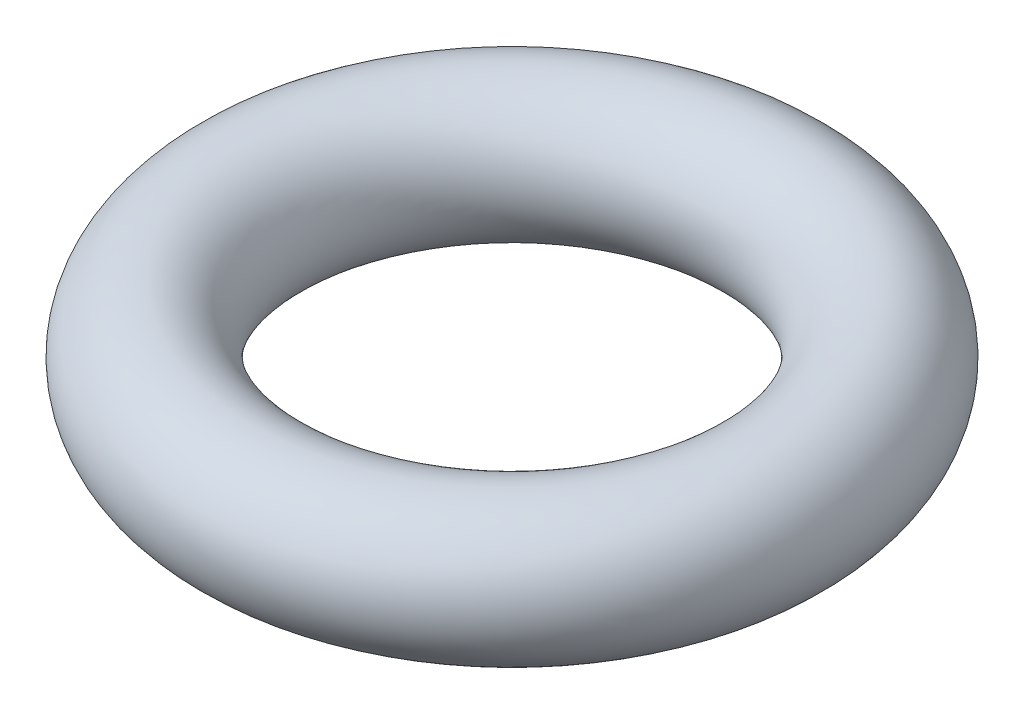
ISO-10303-21;
HEADER;
FILE_DESCRIPTION(('STEP AP214'),'2;1');
FILE_NAME('part.step','',(''),(''),'','','');
FILE_SCHEMA(('AUTOMOTIVE_DESIGN { 1 0 10303 214 1 1 1 1 }'));
ENDSEC;
DATA;
#1=APPLICATION_CONTEXT('core data for automotive mechanical design processes');
#2=APPLICATION_PROTOCOL_DEFINITION('international standard','automotive_design',2000,#1);
#3=PRODUCT_CONTEXT('',#1,'mechanical');
#4=PRODUCT('Part','Part','',(#3));
#5=PRODUCT_RELATED_PRODUCT_CATEGORY('part','',(#4));
#6=PRODUCT_DEFINITION_FORMATION('','',#4);
#7=PRODUCT_DEFINITION_CONTEXT('part definition',#1,'design');
#8=PRODUCT_DEFINITION('design','',#6,#7);
#9=PRODUCT_DEFINITION_SHAPE('','',#8);
#10=(LENGTH_UNIT() NAMED_UNIT(*) SI_UNIT(.MILLI.,.METRE.));
#11=(NAMED_UNIT(*) PLANE_ANGLE_UNIT() SI_UNIT($,.RADIAN.));
#12=(NAMED_UNIT(*) SI_UNIT($,.STERADIAN.) SOLID_ANGLE_UNIT());
#13=UNCERTAINTY_MEASURE_WITH_UNIT(LENGTH_MEASURE(1.E-05),#10,'distance_accuracy_value','');
#14=(GEOMETRIC_REPRESENTATION_CONTEXT(3) GLOBAL_UNCERTAINTY_ASSIGNED_CONTEXT((#13)) GLOBAL_UNIT_ASSIGNED_CONTEXT((#10,
#11,#12)) REPRESENTATION_CONTEXT('',''));
#15=CARTESIAN_POINT('',(0.,0.,0.));
#16=DIRECTION('',(0.,0.,1.));
#17=DIRECTION('',(1.,0.,0.));
#18=AXIS2_PLACEMENT_3D('',#15,#16,#17);
#19=CARTESIAN_POINT('',(0.,0.,0.));
#20=DIRECTION('',(0.,-1.,0.));
#21=DIRECTION('',(0.,0.,-1.));
#22=AXIS2_PLACEMENT_3D('',#19,#20,#21);
#23=TOROIDAL_SURFACE('',#22,30.,8.);
#24=CARTESIAN_POINT('',(0.,0.,-38.));
#25=VERTEX_POINT('',#24);
#26=VERTEX_LOOP('',#25);
#27=FACE_BOUND('',#26,.T.);
#28=ADVANCED_FACE('F27',(#27),#23,.T.);
#29=CLOSED_SHELL('',(#28));
#30=MANIFOLD_SOLID_BREP('B2',#29);
#31=ADVANCED_BREP_SHAPE_REPRESENTATION('',(#18,#30),#14);
#32=SHAPE_DEFINITION_REPRESENTATION(#9,#31);
ENDSEC;
END-ISO-10303-21;
